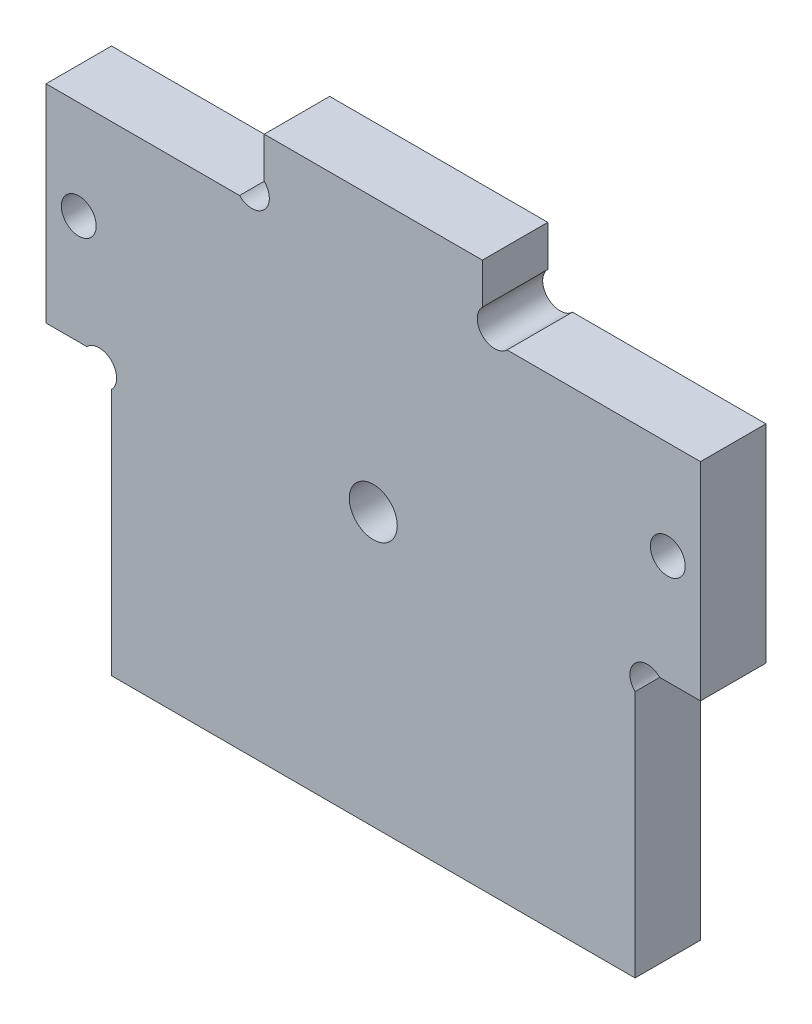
from build123d import *

# Parameters (mm, degrees)
ESQUISSE1_R        = 1.6
ESQUISSE1_R_2      = 2.2
BOSS_EXTRU_1_DEPTH = 6


with BuildPart() as part:
    # Esquisse1 → Boss.-Extru.1 (new body)
    with BuildSketch(Plane.XY):
        with BuildLine():
            Line((10, 46.2627417), (10, 50))
            Line((10, 50), (-10, 50))
            Line((-10, 50), (-10, 46.2627417))
            ThreePointArc((-10, 46.2627417), (-10, 44), (-12.2627417, 44))
            Line((-12.2627417, 44), (-30, 44))
            Line((-30, 44), (-30, 25))
            Line((-30, 25), (-26.2627417, 25))
            ThreePointArc((-26.2627417, 25), (-24, 25), (-24, 22.7372583))
            Line((-24, 22.7372583), (-24, 0))
            Line((-24, 0), (24, 0))
            Line((24, 0), (24, 22.7372583))
            ThreePointArc((24, 22.7372583), (24, 25), (26.2627417, 25))
            Line((26.2627417, 25), (30, 25))
            Line((30, 25), (30, 44))
            Line((30, 44), (12.2627417, 44))
            ThreePointArc((12.2627417, 44), (10, 44), (10, 46.2627417))
        make_face()
        with Locations((27, 35)):
            Circle(ESQUISSE1_R, mode=Mode.SUBTRACT)
        with Locations(Location((-27, 35, 0), (0, 0, 180))):
            Circle(ESQUISSE1_R, mode=Mode.SUBTRACT)
        with Locations((0, 25)):
            Circle(ESQUISSE1_R_2, mode=Mode.SUBTRACT)
    extrude(amount=BOSS_EXTRU_1_DEPTH)


solid = part.part
